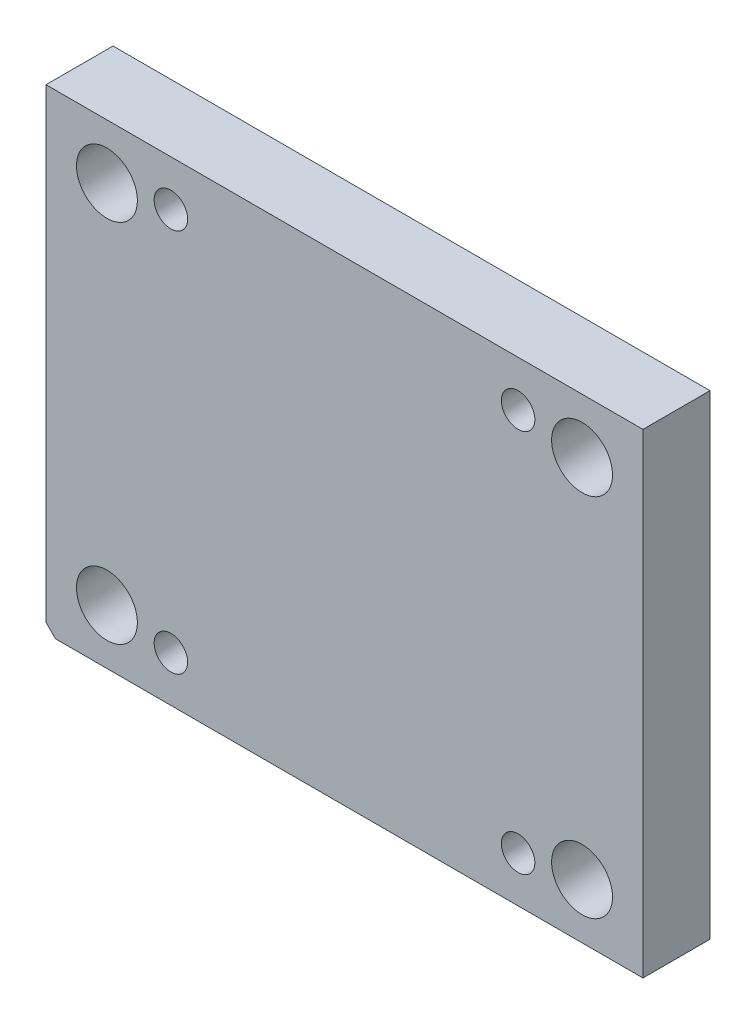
ISO-10303-21;
HEADER;
FILE_DESCRIPTION(('STEP AP214'),'2;1');
FILE_NAME('part.step','',(''),(''),'','','');
FILE_SCHEMA(('AUTOMOTIVE_DESIGN { 1 0 10303 214 1 1 1 1 }'));
ENDSEC;
DATA;
#1=APPLICATION_CONTEXT('core data for automotive mechanical design processes');
#2=APPLICATION_PROTOCOL_DEFINITION('international standard','automotive_design',2000,#1);
#3=PRODUCT_CONTEXT('',#1,'mechanical');
#4=PRODUCT('Part','Part','',(#3));
#5=PRODUCT_RELATED_PRODUCT_CATEGORY('part','',(#4));
#6=PRODUCT_DEFINITION_FORMATION('','',#4);
#7=PRODUCT_DEFINITION_CONTEXT('part definition',#1,'design');
#8=PRODUCT_DEFINITION('design','',#6,#7);
#9=PRODUCT_DEFINITION_SHAPE('','',#8);
#10=(LENGTH_UNIT() NAMED_UNIT(*) SI_UNIT(.MILLI.,.METRE.));
#11=(NAMED_UNIT(*) PLANE_ANGLE_UNIT() SI_UNIT($,.RADIAN.));
#12=(NAMED_UNIT(*) SI_UNIT($,.STERADIAN.) SOLID_ANGLE_UNIT());
#13=UNCERTAINTY_MEASURE_WITH_UNIT(LENGTH_MEASURE(1.E-05),#10,'distance_accuracy_value','');
#14=(GEOMETRIC_REPRESENTATION_CONTEXT(3) GLOBAL_UNCERTAINTY_ASSIGNED_CONTEXT((#13)) GLOBAL_UNIT_ASSIGNED_CONTEXT((#10,
#11,#12)) REPRESENTATION_CONTEXT('',''));
#15=CARTESIAN_POINT('',(0.,0.,0.));
#16=DIRECTION('',(0.,0.,1.));
#17=DIRECTION('',(1.,0.,0.));
#18=AXIS2_PLACEMENT_3D('',#15,#16,#17);
#19=CARTESIAN_POINT('',(-98.,-78.,-272.503492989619));
#20=DIRECTION('',(-1.,0.,0.));
#21=DIRECTION('',(0.,-1.,0.));
#22=AXIS2_PLACEMENT_3D('',#19,#20,#21);
#23=PLANE('',#22);
#24=DIRECTION('',(0.,1.,0.));
#25=VECTOR('',#24,1.);
#26=CARTESIAN_POINT('',(-98.,-78.,-22.));
#27=LINE('',#26,#25);
#28=CARTESIAN_POINT('',(-98.,-74.88,-22.));
#29=VERTEX_POINT('',#28);
#30=CARTESIAN_POINT('',(-98.,78.,-22.));
#31=VERTEX_POINT('',#30);
#32=EDGE_CURVE('E108',#29,#31,#27,.T.);
#33=ORIENTED_EDGE('',*,*,#32,.F.);
#34=DIRECTION('',(0.,0.,1.));
#35=VECTOR('',#34,1.);
#36=CARTESIAN_POINT('',(-98.,-74.88,-272.503492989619));
#37=LINE('',#36,#35);
#38=CARTESIAN_POINT('',(-98.,-74.88,0.));
#39=VERTEX_POINT('',#38);
#40=EDGE_CURVE('E107',#29,#39,#37,.T.);
#41=ORIENTED_EDGE('',*,*,#40,.T.);
#42=DIRECTION('',(0.,-1.,0.));
#43=VECTOR('',#42,1.);
#44=CARTESIAN_POINT('',(-98.,-78.,0.));
#45=LINE('',#44,#43);
#46=CARTESIAN_POINT('',(-98.,78.,0.));
#47=VERTEX_POINT('',#46);
#48=EDGE_CURVE('E85',#47,#39,#45,.T.);
#49=ORIENTED_EDGE('',*,*,#48,.F.);
#50=DIRECTION('',(0.,0.,1.));
#51=VECTOR('',#50,1.);
#52=CARTESIAN_POINT('',(-98.,78.,-272.503492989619));
#53=LINE('',#52,#51);
#54=EDGE_CURVE('E102',#31,#47,#53,.T.);
#55=ORIENTED_EDGE('',*,*,#54,.F.);
#56=EDGE_LOOP('',(#33,#41,#49,#55));
#57=FACE_BOUND('',#56,.T.);
#58=ADVANCED_FACE('F34',(#57),#23,.T.);
#59=CARTESIAN_POINT('',(-98.,78.,-272.503492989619));
#60=DIRECTION('',(0.,1.,0.));
#61=DIRECTION('',(-1.,0.,0.));
#62=AXIS2_PLACEMENT_3D('',#59,#60,#61);
#63=PLANE('',#62);
#64=DIRECTION('',(1.,0.,0.));
#65=VECTOR('',#64,1.);
#66=CARTESIAN_POINT('',(-98.,78.,-22.));
#67=LINE('',#66,#65);
#68=CARTESIAN_POINT('',(98.,78.,-22.));
#69=VERTEX_POINT('',#68);
#70=EDGE_CURVE('E124',#31,#69,#67,.T.);
#71=ORIENTED_EDGE('',*,*,#70,.F.);
#72=ORIENTED_EDGE('',*,*,#54,.T.);
#73=DIRECTION('',(-1.,0.,0.));
#74=VECTOR('',#73,1.);
#75=CARTESIAN_POINT('',(-98.,78.,0.));
#76=LINE('',#75,#74);
#77=CARTESIAN_POINT('',(98.,78.,0.));
#78=VERTEX_POINT('',#77);
#79=EDGE_CURVE('E94',#78,#47,#76,.T.);
#80=ORIENTED_EDGE('',*,*,#79,.F.);
#81=DIRECTION('',(0.,0.,1.));
#82=VECTOR('',#81,1.);
#83=CARTESIAN_POINT('',(98.,78.,-272.503492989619));
#84=LINE('',#83,#82);
#85=EDGE_CURVE('E93',#69,#78,#84,.T.);
#86=ORIENTED_EDGE('',*,*,#85,.F.);
#87=EDGE_LOOP('',(#71,#72,#80,#86));
#88=FACE_BOUND('',#87,.T.);
#89=ADVANCED_FACE('F213',(#88),#63,.T.);
#90=CARTESIAN_POINT('',(98.,-78.,-272.503492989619));
#91=DIRECTION('',(1.,0.,0.));
#92=DIRECTION('',(0.,1.,0.));
#93=AXIS2_PLACEMENT_3D('',#90,#91,#92);
#94=PLANE('',#93);
#95=DIRECTION('',(0.,-1.,0.));
#96=VECTOR('',#95,1.);
#97=CARTESIAN_POINT('',(98.,-78.,-22.));
#98=LINE('',#97,#96);
#99=CARTESIAN_POINT('',(98.,-78.,-22.));
#100=VERTEX_POINT('',#99);
#101=EDGE_CURVE('E104',#69,#100,#98,.T.);
#102=ORIENTED_EDGE('',*,*,#101,.F.);
#103=ORIENTED_EDGE('',*,*,#85,.T.);
#104=DIRECTION('',(0.,1.,0.));
#105=VECTOR('',#104,1.);
#106=CARTESIAN_POINT('',(98.,-78.,0.));
#107=LINE('',#106,#105);
#108=CARTESIAN_POINT('',(98.,-78.,0.));
#109=VERTEX_POINT('',#108);
#110=EDGE_CURVE('E83',#109,#78,#107,.T.);
#111=ORIENTED_EDGE('',*,*,#110,.F.);
#112=DIRECTION('',(0.,0.,1.));
#113=VECTOR('',#112,1.);
#114=CARTESIAN_POINT('',(98.,-78.,-272.503492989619));
#115=LINE('',#114,#113);
#116=EDGE_CURVE('E88',#100,#109,#115,.T.);
#117=ORIENTED_EDGE('',*,*,#116,.F.);
#118=EDGE_LOOP('',(#102,#103,#111,#117));
#119=FACE_BOUND('',#118,.T.);
#120=ADVANCED_FACE('F96',(#119),#94,.T.);
#121=CARTESIAN_POINT('',(-98.,-78.,-272.503492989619));
#122=DIRECTION('',(0.,-1.,0.));
#123=DIRECTION('',(1.,0.,0.));
#124=AXIS2_PLACEMENT_3D('',#121,#122,#123);
#125=PLANE('',#124);
#126=DIRECTION('',(1.,0.,0.));
#127=VECTOR('',#126,1.);
#128=CARTESIAN_POINT('',(-98.,-78.,0.));
#129=LINE('',#128,#127);
#130=CARTESIAN_POINT('',(-94.88,-78.,0.));
#131=VERTEX_POINT('',#130);
#132=EDGE_CURVE('E78',#131,#109,#129,.T.);
#133=ORIENTED_EDGE('',*,*,#132,.F.);
#134=DIRECTION('',(0.,0.,-1.));
#135=VECTOR('',#134,1.);
#136=CARTESIAN_POINT('',(-94.88,-78.,-272.503492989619));
#137=LINE('',#136,#135);
#138=CARTESIAN_POINT('',(-94.88,-78.,-22.));
#139=VERTEX_POINT('',#138);
#140=EDGE_CURVE('E42',#131,#139,#137,.T.);
#141=ORIENTED_EDGE('',*,*,#140,.T.);
#142=DIRECTION('',(-1.,0.,0.));
#143=VECTOR('',#142,1.);
#144=CARTESIAN_POINT('',(-98.,-78.,-22.));
#145=LINE('',#144,#143);
#146=EDGE_CURVE('E90',#100,#139,#145,.T.);
#147=ORIENTED_EDGE('',*,*,#146,.F.);
#148=ORIENTED_EDGE('',*,*,#116,.T.);
#149=EDGE_LOOP('',(#133,#141,#147,#148));
#150=FACE_BOUND('',#149,.T.);
#151=ADVANCED_FACE('F89',(#150),#125,.T.);
#152=CARTESIAN_POINT('',(0.,0.,0.));
#153=DIRECTION('',(0.,0.,-1.));
#154=DIRECTION('',(-1.,0.,0.));
#155=AXIS2_PLACEMENT_3D('',#152,#153,#154);
#156=PLANE('',#155);
#157=CARTESIAN_POINT('',(-57.,-62.9999999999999,0.));
#158=DIRECTION('',(0.,0.,-1.));
#159=DIRECTION('',(-1.,0.,0.));
#160=AXIS2_PLACEMENT_3D('',#157,#158,#159);
#161=CIRCLE('',#160,5.5);
#162=CARTESIAN_POINT('',(-62.5,-62.9999999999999,0.));
#163=VERTEX_POINT('',#162);
#164=EDGE_CURVE('E183',#163,#163,#161,.T.);
#165=ORIENTED_EDGE('',*,*,#164,.T.);
#166=EDGE_LOOP('',(#165));
#167=FACE_BOUND('',#166,.T.);
#168=CARTESIAN_POINT('',(-57.,63.0000000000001,0.));
#169=DIRECTION('',(0.,0.,-1.));
#170=DIRECTION('',(-1.,0.,0.));
#171=AXIS2_PLACEMENT_3D('',#168,#169,#170);
#172=CIRCLE('',#171,5.5);
#173=CARTESIAN_POINT('',(-62.5,63.0000000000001,0.));
#174=VERTEX_POINT('',#173);
#175=EDGE_CURVE('E171',#174,#174,#172,.T.);
#176=ORIENTED_EDGE('',*,*,#175,.T.);
#177=EDGE_LOOP('',(#176));
#178=FACE_BOUND('',#177,.T.);
#179=CARTESIAN_POINT('',(57.,63.0000000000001,0.));
#180=DIRECTION('',(0.,0.,-1.));
#181=DIRECTION('',(-1.,0.,0.));
#182=AXIS2_PLACEMENT_3D('',#179,#180,#181);
#183=CIRCLE('',#182,5.5);
#184=CARTESIAN_POINT('',(51.5,63.0000000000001,0.));
#185=VERTEX_POINT('',#184);
#186=EDGE_CURVE('E159',#185,#185,#183,.T.);
#187=ORIENTED_EDGE('',*,*,#186,.T.);
#188=EDGE_LOOP('',(#187));
#189=FACE_BOUND('',#188,.T.);
#190=CARTESIAN_POINT('',(57.,-62.9999999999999,0.));
#191=DIRECTION('',(0.,0.,-1.));
#192=DIRECTION('',(-1.,0.,0.));
#193=AXIS2_PLACEMENT_3D('',#190,#191,#192);
#194=CIRCLE('',#193,5.50000000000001);
#195=CARTESIAN_POINT('',(51.5,-62.9999999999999,0.));
#196=VERTEX_POINT('',#195);
#197=EDGE_CURVE('E147',#196,#196,#194,.T.);
#198=ORIENTED_EDGE('',*,*,#197,.T.);
#199=EDGE_LOOP('',(#198));
#200=FACE_BOUND('',#199,.T.);
#201=CARTESIAN_POINT('',(-78.,-59.9999999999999,0.));
#202=DIRECTION('',(0.,0.,1.));
#203=DIRECTION('',(1.,0.,0.));
#204=AXIS2_PLACEMENT_3D('',#201,#202,#203);
#205=CIRCLE('',#204,9.99999999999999);
#206=CARTESIAN_POINT('',(-68.,-59.9999999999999,0.));
#207=VERTEX_POINT('',#206);
#208=EDGE_CURVE('E144',#207,#207,#205,.T.);
#209=ORIENTED_EDGE('',*,*,#208,.F.);
#210=EDGE_LOOP('',(#209));
#211=FACE_BOUND('',#210,.T.);
#212=CARTESIAN_POINT('',(-78.,60.0000000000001,0.));
#213=DIRECTION('',(0.,0.,1.));
#214=DIRECTION('',(1.,0.,0.));
#215=AXIS2_PLACEMENT_3D('',#212,#213,#214);
#216=CIRCLE('',#215,9.99999999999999);
#217=CARTESIAN_POINT('',(-68.,60.0000000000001,0.));
#218=VERTEX_POINT('',#217);
#219=EDGE_CURVE('E138',#218,#218,#216,.T.);
#220=ORIENTED_EDGE('',*,*,#219,.F.);
#221=EDGE_LOOP('',(#220));
#222=FACE_BOUND('',#221,.T.);
#223=CARTESIAN_POINT('',(78.,60.0000000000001,0.));
#224=DIRECTION('',(0.,0.,1.));
#225=DIRECTION('',(1.,0.,0.));
#226=AXIS2_PLACEMENT_3D('',#223,#224,#225);
#227=CIRCLE('',#226,9.99999999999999);
#228=CARTESIAN_POINT('',(88.,60.0000000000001,0.));
#229=VERTEX_POINT('',#228);
#230=EDGE_CURVE('E132',#229,#229,#227,.T.);
#231=ORIENTED_EDGE('',*,*,#230,.F.);
#232=EDGE_LOOP('',(#231));
#233=FACE_BOUND('',#232,.T.);
#234=CARTESIAN_POINT('',(78.,-59.9999999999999,0.));
#235=DIRECTION('',(0.,0.,1.));
#236=DIRECTION('',(1.,0.,0.));
#237=AXIS2_PLACEMENT_3D('',#234,#235,#236);
#238=CIRCLE('',#237,9.99999999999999);
#239=CARTESIAN_POINT('',(88.,-59.9999999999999,0.));
#240=VERTEX_POINT('',#239);
#241=EDGE_CURVE('E120',#240,#240,#238,.T.);
#242=ORIENTED_EDGE('',*,*,#241,.F.);
#243=EDGE_LOOP('',(#242));
#244=FACE_BOUND('',#243,.T.);
#245=ORIENTED_EDGE('',*,*,#48,.T.);
#246=DIRECTION('',(-0.707106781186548,0.707106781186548,0.));
#247=VECTOR('',#246,1.);
#248=CARTESIAN_POINT('',(-98.,-74.88,0.));
#249=LINE('',#248,#247);
#250=EDGE_CURVE('E56',#39,#131,#249,.F.);
#251=ORIENTED_EDGE('',*,*,#250,.T.);
#252=ORIENTED_EDGE('',*,*,#132,.T.);
#253=ORIENTED_EDGE('',*,*,#110,.T.);
#254=ORIENTED_EDGE('',*,*,#79,.T.);
#255=EDGE_LOOP('',(#245,#251,#252,#253,#254));
#256=FACE_BOUND('',#255,.T.);
#257=ADVANCED_FACE('F80',(#167,#178,#189,#200,#211,#222,#233,#244,#256),#156,.F.);
#258=CARTESIAN_POINT('',(0.,0.,-22.));
#259=DIRECTION('',(0.,0.,1.));
#260=DIRECTION('',(1.,0.,0.));
#261=AXIS2_PLACEMENT_3D('',#258,#259,#260);
#262=PLANE('',#261);
#263=CARTESIAN_POINT('',(0.,0.,-22.));
#264=DIRECTION('',(0.,0.,1.));
#265=DIRECTION('',(1.,0.,0.));
#266=AXIS2_PLACEMENT_3D('',#263,#264,#265);
#267=CIRCLE('',#266,45.);
#268=CARTESIAN_POINT('',(45.,0.,-22.));
#269=VERTEX_POINT('',#268);
#270=EDGE_CURVE('E196',#269,#269,#267,.T.);
#271=ORIENTED_EDGE('',*,*,#270,.T.);
#272=EDGE_LOOP('',(#271));
#273=FACE_BOUND('',#272,.T.);
#274=CARTESIAN_POINT('',(-57.,-62.9999999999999,-22.));
#275=DIRECTION('',(0.,0.,-1.));
#276=DIRECTION('',(-1.,0.,0.));
#277=AXIS2_PLACEMENT_3D('',#274,#275,#276);
#278=CIRCLE('',#277,9.);
#279=CARTESIAN_POINT('',(-66.,-62.9999999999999,-22.));
#280=VERTEX_POINT('',#279);
#281=EDGE_CURVE('E192',#280,#280,#278,.T.);
#282=ORIENTED_EDGE('',*,*,#281,.F.);
#283=EDGE_LOOP('',(#282));
#284=FACE_BOUND('',#283,.T.);
#285=CARTESIAN_POINT('',(-57.,63.0000000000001,-22.));
#286=DIRECTION('',(0.,0.,-1.));
#287=DIRECTION('',(-1.,0.,0.));
#288=AXIS2_PLACEMENT_3D('',#285,#286,#287);
#289=CIRCLE('',#288,9.);
#290=CARTESIAN_POINT('',(-66.,63.0000000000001,-22.));
#291=VERTEX_POINT('',#290);
#292=EDGE_CURVE('E180',#291,#291,#289,.T.);
#293=ORIENTED_EDGE('',*,*,#292,.F.);
#294=EDGE_LOOP('',(#293));
#295=FACE_BOUND('',#294,.T.);
#296=CARTESIAN_POINT('',(57.,63.0000000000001,-22.));
#297=DIRECTION('',(0.,0.,-1.));
#298=DIRECTION('',(-1.,0.,0.));
#299=AXIS2_PLACEMENT_3D('',#296,#297,#298);
#300=CIRCLE('',#299,9.);
#301=CARTESIAN_POINT('',(48.,63.0000000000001,-22.));
#302=VERTEX_POINT('',#301);
#303=EDGE_CURVE('E168',#302,#302,#300,.T.);
#304=ORIENTED_EDGE('',*,*,#303,.F.);
#305=EDGE_LOOP('',(#304));
#306=FACE_BOUND('',#305,.T.);
#307=CARTESIAN_POINT('',(57.,-62.9999999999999,-22.));
#308=DIRECTION('',(0.,0.,-1.));
#309=DIRECTION('',(-1.,0.,0.));
#310=AXIS2_PLACEMENT_3D('',#307,#308,#309);
#311=CIRCLE('',#310,8.99999999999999);
#312=CARTESIAN_POINT('',(48.,-62.9999999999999,-22.));
#313=VERTEX_POINT('',#312);
#314=EDGE_CURVE('E156',#313,#313,#311,.T.);
#315=ORIENTED_EDGE('',*,*,#314,.F.);
#316=EDGE_LOOP('',(#315));
#317=FACE_BOUND('',#316,.T.);
#318=CARTESIAN_POINT('',(-78.,-59.9999999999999,-22.));
#319=DIRECTION('',(0.,0.,1.));
#320=DIRECTION('',(1.,0.,0.));
#321=AXIS2_PLACEMENT_3D('',#318,#319,#320);
#322=CIRCLE('',#321,9.99999999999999);
#323=CARTESIAN_POINT('',(-68.,-59.9999999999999,-22.));
#324=VERTEX_POINT('',#323);
#325=EDGE_CURVE('E141',#324,#324,#322,.T.);
#326=ORIENTED_EDGE('',*,*,#325,.T.);
#327=EDGE_LOOP('',(#326));
#328=FACE_BOUND('',#327,.T.);
#329=CARTESIAN_POINT('',(-78.,60.0000000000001,-22.));
#330=DIRECTION('',(0.,0.,1.));
#331=DIRECTION('',(1.,0.,0.));
#332=AXIS2_PLACEMENT_3D('',#329,#330,#331);
#333=CIRCLE('',#332,9.99999999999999);
#334=CARTESIAN_POINT('',(-68.,60.0000000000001,-22.));
#335=VERTEX_POINT('',#334);
#336=EDGE_CURVE('E135',#335,#335,#333,.T.);
#337=ORIENTED_EDGE('',*,*,#336,.T.);
#338=EDGE_LOOP('',(#337));
#339=FACE_BOUND('',#338,.T.);
#340=CARTESIAN_POINT('',(78.,60.0000000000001,-22.));
#341=DIRECTION('',(0.,0.,1.));
#342=DIRECTION('',(1.,0.,0.));
#343=AXIS2_PLACEMENT_3D('',#340,#341,#342);
#344=CIRCLE('',#343,9.99999999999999);
#345=CARTESIAN_POINT('',(88.,60.0000000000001,-22.));
#346=VERTEX_POINT('',#345);
#347=EDGE_CURVE('E129',#346,#346,#344,.T.);
#348=ORIENTED_EDGE('',*,*,#347,.T.);
#349=EDGE_LOOP('',(#348));
#350=FACE_BOUND('',#349,.T.);
#351=CARTESIAN_POINT('',(78.,-59.9999999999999,-22.));
#352=DIRECTION('',(0.,0.,1.));
#353=DIRECTION('',(1.,0.,0.));
#354=AXIS2_PLACEMENT_3D('',#351,#352,#353);
#355=CIRCLE('',#354,9.99999999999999);
#356=CARTESIAN_POINT('',(88.,-59.9999999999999,-22.));
#357=VERTEX_POINT('',#356);
#358=EDGE_CURVE('E118',#357,#357,#355,.T.);
#359=ORIENTED_EDGE('',*,*,#358,.T.);
#360=EDGE_LOOP('',(#359));
#361=FACE_BOUND('',#360,.T.);
#362=ORIENTED_EDGE('',*,*,#146,.T.);
#363=DIRECTION('',(0.707106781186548,-0.707106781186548,0.));
#364=VECTOR('',#363,1.);
#365=CARTESIAN_POINT('',(-98.,-74.88,-22.));
#366=LINE('',#365,#364);
#367=EDGE_CURVE('E11',#139,#29,#366,.F.);
#368=ORIENTED_EDGE('',*,*,#367,.T.);
#369=ORIENTED_EDGE('',*,*,#32,.T.);
#370=ORIENTED_EDGE('',*,*,#70,.T.);
#371=ORIENTED_EDGE('',*,*,#101,.T.);
#372=EDGE_LOOP('',(#362,#368,#369,#370,#371));
#373=FACE_BOUND('',#372,.T.);
#374=ADVANCED_FACE('F226',(#273,#284,#295,#306,#317,#328,#339,#350,#361,#373),#262,.F.);
#375=CARTESIAN_POINT('',(78.,-59.9999999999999,0.));
#376=DIRECTION('',(0.,0.,1.));
#377=DIRECTION('',(1.,0.,0.));
#378=AXIS2_PLACEMENT_3D('',#375,#376,#377);
#379=CYLINDRICAL_SURFACE('',#378,9.99999999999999);
#380=ORIENTED_EDGE('',*,*,#358,.F.);
#381=EDGE_LOOP('',(#380));
#382=FACE_BOUND('',#381,.T.);
#383=ORIENTED_EDGE('',*,*,#241,.T.);
#384=EDGE_LOOP('',(#383));
#385=FACE_BOUND('',#384,.T.);
#386=ADVANCED_FACE('F230',(#382,#385),#379,.F.);
#387=CARTESIAN_POINT('',(78.,60.0000000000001,0.));
#388=DIRECTION('',(0.,0.,1.));
#389=DIRECTION('',(1.,0.,0.));
#390=AXIS2_PLACEMENT_3D('',#387,#388,#389);
#391=CYLINDRICAL_SURFACE('',#390,9.99999999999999);
#392=ORIENTED_EDGE('',*,*,#347,.F.);
#393=EDGE_LOOP('',(#392));
#394=FACE_BOUND('',#393,.T.);
#395=ORIENTED_EDGE('',*,*,#230,.T.);
#396=EDGE_LOOP('',(#395));
#397=FACE_BOUND('',#396,.T.);
#398=ADVANCED_FACE('F234',(#394,#397),#391,.F.);
#399=CARTESIAN_POINT('',(-78.,60.0000000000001,0.));
#400=DIRECTION('',(0.,0.,1.));
#401=DIRECTION('',(1.,0.,0.));
#402=AXIS2_PLACEMENT_3D('',#399,#400,#401);
#403=CYLINDRICAL_SURFACE('',#402,9.99999999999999);
#404=ORIENTED_EDGE('',*,*,#336,.F.);
#405=EDGE_LOOP('',(#404));
#406=FACE_BOUND('',#405,.T.);
#407=ORIENTED_EDGE('',*,*,#219,.T.);
#408=EDGE_LOOP('',(#407));
#409=FACE_BOUND('',#408,.T.);
#410=ADVANCED_FACE('F238',(#406,#409),#403,.F.);
#411=CARTESIAN_POINT('',(-78.,-59.9999999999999,0.));
#412=DIRECTION('',(0.,0.,1.));
#413=DIRECTION('',(1.,0.,0.));
#414=AXIS2_PLACEMENT_3D('',#411,#412,#413);
#415=CYLINDRICAL_SURFACE('',#414,9.99999999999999);
#416=ORIENTED_EDGE('',*,*,#325,.F.);
#417=EDGE_LOOP('',(#416));
#418=FACE_BOUND('',#417,.T.);
#419=ORIENTED_EDGE('',*,*,#208,.T.);
#420=EDGE_LOOP('',(#419));
#421=FACE_BOUND('',#420,.T.);
#422=ADVANCED_FACE('F242',(#418,#421),#415,.F.);
#423=CARTESIAN_POINT('',(57.,-62.9999999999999,-22.));
#424=DIRECTION('',(0.,0.,-1.));
#425=DIRECTION('',(-1.,0.,0.));
#426=AXIS2_PLACEMENT_3D('',#423,#424,#425);
#427=CYLINDRICAL_SURFACE('',#426,5.50000000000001);
#428=ORIENTED_EDGE('',*,*,#197,.F.);
#429=EDGE_LOOP('',(#428));
#430=FACE_BOUND('',#429,.T.);
#431=CARTESIAN_POINT('',(57.,-62.9999999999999,-9.));
#432=DIRECTION('',(0.,0.,-1.));
#433=DIRECTION('',(-1.,0.,0.));
#434=AXIS2_PLACEMENT_3D('',#431,#432,#433);
#435=CIRCLE('',#434,5.50000000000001);
#436=CARTESIAN_POINT('',(51.5,-62.9999999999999,-9.));
#437=VERTEX_POINT('',#436);
#438=EDGE_CURVE('E150',#437,#437,#435,.T.);
#439=ORIENTED_EDGE('',*,*,#438,.T.);
#440=EDGE_LOOP('',(#439));
#441=FACE_BOUND('',#440,.T.);
#442=ADVANCED_FACE('F246',(#430,#441),#427,.F.);
#443=CARTESIAN_POINT('',(62.5,-62.9999999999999,-9.));
#444=DIRECTION('',(0.,0.,1.));
#445=DIRECTION('',(1.,0.,0.));
#446=AXIS2_PLACEMENT_3D('',#443,#444,#445);
#447=PLANE('',#446);
#448=ORIENTED_EDGE('',*,*,#438,.F.);
#449=EDGE_LOOP('',(#448));
#450=FACE_BOUND('',#449,.T.);
#451=CARTESIAN_POINT('',(57.,-62.9999999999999,-9.));
#452=DIRECTION('',(0.,0.,-1.));
#453=DIRECTION('',(-1.,0.,0.));
#454=AXIS2_PLACEMENT_3D('',#451,#452,#453);
#455=CIRCLE('',#454,8.99999999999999);
#456=CARTESIAN_POINT('',(48.,-62.9999999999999,-9.));
#457=VERTEX_POINT('',#456);
#458=EDGE_CURVE('E153',#457,#457,#455,.T.);
#459=ORIENTED_EDGE('',*,*,#458,.T.);
#460=EDGE_LOOP('',(#459));
#461=FACE_BOUND('',#460,.T.);
#462=ADVANCED_FACE('F250',(#450,#461),#447,.F.);
#463=CARTESIAN_POINT('',(57.,-62.9999999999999,-22.));
#464=DIRECTION('',(0.,0.,-1.));
#465=DIRECTION('',(-1.,0.,0.));
#466=AXIS2_PLACEMENT_3D('',#463,#464,#465);
#467=CYLINDRICAL_SURFACE('',#466,8.99999999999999);
#468=ORIENTED_EDGE('',*,*,#458,.F.);
#469=EDGE_LOOP('',(#468));
#470=FACE_BOUND('',#469,.T.);
#471=ORIENTED_EDGE('',*,*,#314,.T.);
#472=EDGE_LOOP('',(#471));
#473=FACE_BOUND('',#472,.T.);
#474=ADVANCED_FACE('F254',(#470,#473),#467,.F.);
#475=CARTESIAN_POINT('',(57.,63.0000000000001,-22.));
#476=DIRECTION('',(0.,0.,-1.));
#477=DIRECTION('',(-1.,0.,0.));
#478=AXIS2_PLACEMENT_3D('',#475,#476,#477);
#479=CYLINDRICAL_SURFACE('',#478,5.5);
#480=ORIENTED_EDGE('',*,*,#186,.F.);
#481=EDGE_LOOP('',(#480));
#482=FACE_BOUND('',#481,.T.);
#483=CARTESIAN_POINT('',(57.,63.0000000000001,-9.));
#484=DIRECTION('',(0.,0.,-1.));
#485=DIRECTION('',(-1.,0.,0.));
#486=AXIS2_PLACEMENT_3D('',#483,#484,#485);
#487=CIRCLE('',#486,5.5);
#488=CARTESIAN_POINT('',(51.5,63.0000000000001,-9.));
#489=VERTEX_POINT('',#488);
#490=EDGE_CURVE('E162',#489,#489,#487,.T.);
#491=ORIENTED_EDGE('',*,*,#490,.T.);
#492=EDGE_LOOP('',(#491));
#493=FACE_BOUND('',#492,.T.);
#494=ADVANCED_FACE('F258',(#482,#493),#479,.F.);
#495=CARTESIAN_POINT('',(62.5,63.0000000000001,-9.));
#496=DIRECTION('',(0.,0.,1.));
#497=DIRECTION('',(1.,0.,0.));
#498=AXIS2_PLACEMENT_3D('',#495,#496,#497);
#499=PLANE('',#498);
#500=ORIENTED_EDGE('',*,*,#490,.F.);
#501=EDGE_LOOP('',(#500));
#502=FACE_BOUND('',#501,.T.);
#503=CARTESIAN_POINT('',(57.,63.0000000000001,-9.));
#504=DIRECTION('',(0.,0.,-1.));
#505=DIRECTION('',(-1.,0.,0.));
#506=AXIS2_PLACEMENT_3D('',#503,#504,#505);
#507=CIRCLE('',#506,9.);
#508=CARTESIAN_POINT('',(48.,63.0000000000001,-9.));
#509=VERTEX_POINT('',#508);
#510=EDGE_CURVE('E165',#509,#509,#507,.T.);
#511=ORIENTED_EDGE('',*,*,#510,.T.);
#512=EDGE_LOOP('',(#511));
#513=FACE_BOUND('',#512,.T.);
#514=ADVANCED_FACE('F262',(#502,#513),#499,.F.);
#515=CARTESIAN_POINT('',(57.,63.0000000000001,-22.));
#516=DIRECTION('',(0.,0.,-1.));
#517=DIRECTION('',(-1.,0.,0.));
#518=AXIS2_PLACEMENT_3D('',#515,#516,#517);
#519=CYLINDRICAL_SURFACE('',#518,9.);
#520=ORIENTED_EDGE('',*,*,#510,.F.);
#521=EDGE_LOOP('',(#520));
#522=FACE_BOUND('',#521,.T.);
#523=ORIENTED_EDGE('',*,*,#303,.T.);
#524=EDGE_LOOP('',(#523));
#525=FACE_BOUND('',#524,.T.);
#526=ADVANCED_FACE('F266',(#522,#525),#519,.F.);
#527=CARTESIAN_POINT('',(-57.,63.0000000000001,-22.));
#528=DIRECTION('',(0.,0.,-1.));
#529=DIRECTION('',(-1.,0.,0.));
#530=AXIS2_PLACEMENT_3D('',#527,#528,#529);
#531=CYLINDRICAL_SURFACE('',#530,5.5);
#532=ORIENTED_EDGE('',*,*,#175,.F.);
#533=EDGE_LOOP('',(#532));
#534=FACE_BOUND('',#533,.T.);
#535=CARTESIAN_POINT('',(-57.,63.0000000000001,-9.));
#536=DIRECTION('',(0.,0.,-1.));
#537=DIRECTION('',(-1.,0.,0.));
#538=AXIS2_PLACEMENT_3D('',#535,#536,#537);
#539=CIRCLE('',#538,5.5);
#540=CARTESIAN_POINT('',(-62.5,63.0000000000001,-9.));
#541=VERTEX_POINT('',#540);
#542=EDGE_CURVE('E174',#541,#541,#539,.T.);
#543=ORIENTED_EDGE('',*,*,#542,.T.);
#544=EDGE_LOOP('',(#543));
#545=FACE_BOUND('',#544,.T.);
#546=ADVANCED_FACE('F270',(#534,#545),#531,.F.);
#547=CARTESIAN_POINT('',(-51.5,63.0000000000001,-9.));
#548=DIRECTION('',(0.,0.,1.));
#549=DIRECTION('',(1.,0.,0.));
#550=AXIS2_PLACEMENT_3D('',#547,#548,#549);
#551=PLANE('',#550);
#552=ORIENTED_EDGE('',*,*,#542,.F.);
#553=EDGE_LOOP('',(#552));
#554=FACE_BOUND('',#553,.T.);
#555=CARTESIAN_POINT('',(-57.,63.0000000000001,-9.));
#556=DIRECTION('',(0.,0.,-1.));
#557=DIRECTION('',(-1.,0.,0.));
#558=AXIS2_PLACEMENT_3D('',#555,#556,#557);
#559=CIRCLE('',#558,9.);
#560=CARTESIAN_POINT('',(-66.,63.0000000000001,-9.));
#561=VERTEX_POINT('',#560);
#562=EDGE_CURVE('E177',#561,#561,#559,.T.);
#563=ORIENTED_EDGE('',*,*,#562,.T.);
#564=EDGE_LOOP('',(#563));
#565=FACE_BOUND('',#564,.T.);
#566=ADVANCED_FACE('F274',(#554,#565),#551,.F.);
#567=CARTESIAN_POINT('',(-57.,63.0000000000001,-22.));
#568=DIRECTION('',(0.,0.,-1.));
#569=DIRECTION('',(-1.,0.,0.));
#570=AXIS2_PLACEMENT_3D('',#567,#568,#569);
#571=CYLINDRICAL_SURFACE('',#570,9.);
#572=ORIENTED_EDGE('',*,*,#562,.F.);
#573=EDGE_LOOP('',(#572));
#574=FACE_BOUND('',#573,.T.);
#575=ORIENTED_EDGE('',*,*,#292,.T.);
#576=EDGE_LOOP('',(#575));
#577=FACE_BOUND('',#576,.T.);
#578=ADVANCED_FACE('F278',(#574,#577),#571,.F.);
#579=CARTESIAN_POINT('',(-57.,-62.9999999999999,-22.));
#580=DIRECTION('',(0.,0.,-1.));
#581=DIRECTION('',(-1.,0.,0.));
#582=AXIS2_PLACEMENT_3D('',#579,#580,#581);
#583=CYLINDRICAL_SURFACE('',#582,5.5);
#584=ORIENTED_EDGE('',*,*,#164,.F.);
#585=EDGE_LOOP('',(#584));
#586=FACE_BOUND('',#585,.T.);
#587=CARTESIAN_POINT('',(-57.,-62.9999999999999,-9.));
#588=DIRECTION('',(0.,0.,-1.));
#589=DIRECTION('',(-1.,0.,0.));
#590=AXIS2_PLACEMENT_3D('',#587,#588,#589);
#591=CIRCLE('',#590,5.5);
#592=CARTESIAN_POINT('',(-62.5,-62.9999999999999,-9.));
#593=VERTEX_POINT('',#592);
#594=EDGE_CURVE('E186',#593,#593,#591,.T.);
#595=ORIENTED_EDGE('',*,*,#594,.T.);
#596=EDGE_LOOP('',(#595));
#597=FACE_BOUND('',#596,.T.);
#598=ADVANCED_FACE('F282',(#586,#597),#583,.F.);
#599=CARTESIAN_POINT('',(-51.5,-62.9999999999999,-9.));
#600=DIRECTION('',(0.,0.,1.));
#601=DIRECTION('',(1.,0.,0.));
#602=AXIS2_PLACEMENT_3D('',#599,#600,#601);
#603=PLANE('',#602);
#604=ORIENTED_EDGE('',*,*,#594,.F.);
#605=EDGE_LOOP('',(#604));
#606=FACE_BOUND('',#605,.T.);
#607=CARTESIAN_POINT('',(-57.,-62.9999999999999,-9.));
#608=DIRECTION('',(0.,0.,-1.));
#609=DIRECTION('',(-1.,0.,0.));
#610=AXIS2_PLACEMENT_3D('',#607,#608,#609);
#611=CIRCLE('',#610,9.);
#612=CARTESIAN_POINT('',(-66.,-62.9999999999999,-9.));
#613=VERTEX_POINT('',#612);
#614=EDGE_CURVE('E189',#613,#613,#611,.T.);
#615=ORIENTED_EDGE('',*,*,#614,.T.);
#616=EDGE_LOOP('',(#615));
#617=FACE_BOUND('',#616,.T.);
#618=ADVANCED_FACE('F286',(#606,#617),#603,.F.);
#619=CARTESIAN_POINT('',(-57.,-62.9999999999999,-22.));
#620=DIRECTION('',(0.,0.,-1.));
#621=DIRECTION('',(-1.,0.,0.));
#622=AXIS2_PLACEMENT_3D('',#619,#620,#621);
#623=CYLINDRICAL_SURFACE('',#622,9.);
#624=ORIENTED_EDGE('',*,*,#614,.F.);
#625=EDGE_LOOP('',(#624));
#626=FACE_BOUND('',#625,.T.);
#627=ORIENTED_EDGE('',*,*,#281,.T.);
#628=EDGE_LOOP('',(#627));
#629=FACE_BOUND('',#628,.T.);
#630=ADVANCED_FACE('F290',(#626,#629),#623,.F.);
#631=CARTESIAN_POINT('',(-98.,-74.88,-272.503492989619));
#632=DIRECTION('',(0.707106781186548,0.707106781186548,0.));
#633=DIRECTION('',(0.,0.,1.));
#634=AXIS2_PLACEMENT_3D('',#631,#632,#633);
#635=PLANE('',#634);
#636=ORIENTED_EDGE('',*,*,#367,.F.);
#637=ORIENTED_EDGE('',*,*,#140,.F.);
#638=ORIENTED_EDGE('',*,*,#250,.F.);
#639=ORIENTED_EDGE('',*,*,#40,.F.);
#640=EDGE_LOOP('',(#636,#637,#638,#639));
#641=FACE_BOUND('',#640,.T.);
#642=ADVANCED_FACE('F36',(#641),#635,.F.);
#643=CARTESIAN_POINT('',(0.,0.,-17.95));
#644=DIRECTION('',(0.,0.,-1.));
#645=DIRECTION('',(-1.,0.,0.));
#646=AXIS2_PLACEMENT_3D('',#643,#644,#645);
#647=CYLINDRICAL_SURFACE('',#646,45.);
#648=CARTESIAN_POINT('',(0.,0.,-17.95));
#649=DIRECTION('',(0.,0.,1.));
#650=DIRECTION('',(1.,0.,0.));
#651=AXIS2_PLACEMENT_3D('',#648,#649,#650);
#652=CIRCLE('',#651,45.);
#653=CARTESIAN_POINT('',(45.,0.,-17.95));
#654=VERTEX_POINT('',#653);
#655=EDGE_CURVE('E195',#654,#654,#652,.T.);
#656=ORIENTED_EDGE('',*,*,#655,.T.);
#657=EDGE_LOOP('',(#656));
#658=FACE_BOUND('',#657,.T.);
#659=ORIENTED_EDGE('',*,*,#270,.F.);
#660=EDGE_LOOP('',(#659));
#661=FACE_BOUND('',#660,.T.);
#662=ADVANCED_FACE('F202',(#658,#661),#647,.F.);
#663=CARTESIAN_POINT('',(0.,0.,-17.95));
#664=DIRECTION('',(0.,0.,1.));
#665=DIRECTION('',(1.,0.,0.));
#666=AXIS2_PLACEMENT_3D('',#663,#664,#665);
#667=PLANE('',#666);
#668=ORIENTED_EDGE('',*,*,#655,.F.);
#669=EDGE_LOOP('',(#668));
#670=FACE_BOUND('',#669,.T.);
#671=ADVANCED_FACE('F205',(#670),#667,.F.);
#672=CLOSED_SHELL('',(#58,#89,#120,#151,#257,#374,#386,#398,#410,#422,#442,#462,#474,#494,#514,
#526,#546,#566,#578,#598,#618,#630,#642,#662,#671));
#673=MANIFOLD_SOLID_BREP('B2',#672);
#674=ADVANCED_BREP_SHAPE_REPRESENTATION('',(#18,#673),#14);
#675=SHAPE_DEFINITION_REPRESENTATION(#9,#674);
ENDSEC;
END-ISO-10303-21;
